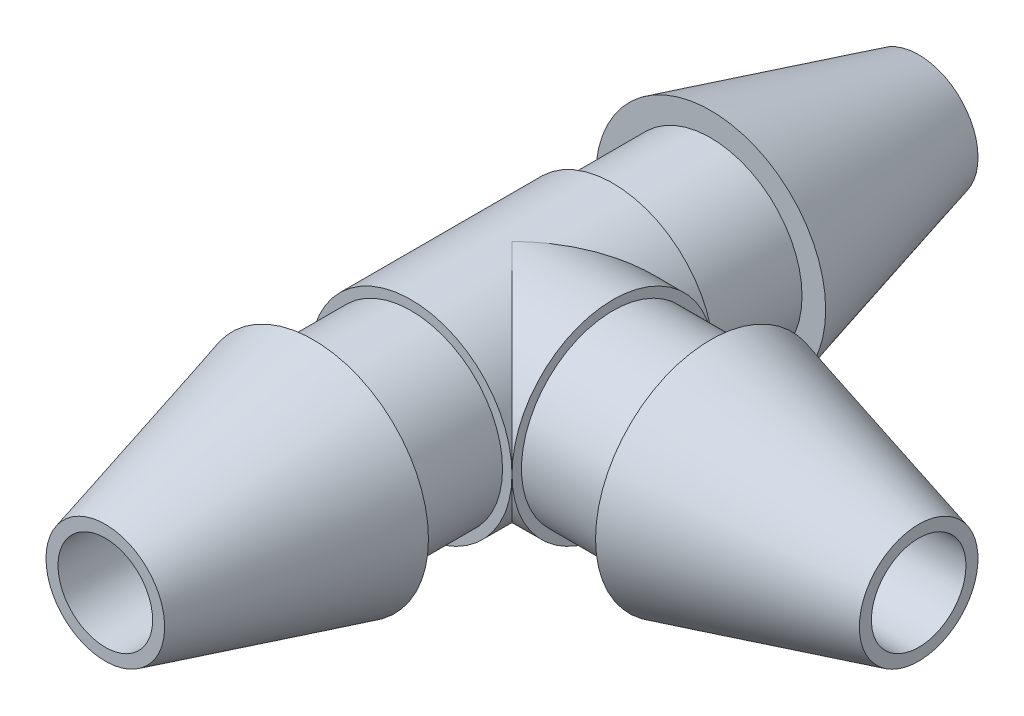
ISO-10303-21;
HEADER;
FILE_DESCRIPTION(('STEP AP214'),'2;1');
FILE_NAME('part.step','',(''),(''),'','','');
FILE_SCHEMA(('AUTOMOTIVE_DESIGN { 1 0 10303 214 1 1 1 1 }'));
ENDSEC;
DATA;
#1=APPLICATION_CONTEXT('core data for automotive mechanical design processes');
#2=APPLICATION_PROTOCOL_DEFINITION('international standard','automotive_design',2000,#1);
#3=PRODUCT_CONTEXT('',#1,'mechanical');
#4=PRODUCT('Part','Part','',(#3));
#5=PRODUCT_RELATED_PRODUCT_CATEGORY('part','',(#4));
#6=PRODUCT_DEFINITION_FORMATION('','',#4);
#7=PRODUCT_DEFINITION_CONTEXT('part definition',#1,'design');
#8=PRODUCT_DEFINITION('design','',#6,#7);
#9=PRODUCT_DEFINITION_SHAPE('','',#8);
#10=(LENGTH_UNIT() NAMED_UNIT(*) SI_UNIT(.MILLI.,.METRE.));
#11=(NAMED_UNIT(*) PLANE_ANGLE_UNIT() SI_UNIT($,.RADIAN.));
#12=(NAMED_UNIT(*) SI_UNIT($,.STERADIAN.) SOLID_ANGLE_UNIT());
#13=UNCERTAINTY_MEASURE_WITH_UNIT(LENGTH_MEASURE(1.E-05),#10,'distance_accuracy_value','');
#14=(GEOMETRIC_REPRESENTATION_CONTEXT(3) GLOBAL_UNCERTAINTY_ASSIGNED_CONTEXT((#13)) GLOBAL_UNIT_ASSIGNED_CONTEXT((#10,
#11,#12)) REPRESENTATION_CONTEXT('',''));
#15=CARTESIAN_POINT('',(0.,0.,0.));
#16=DIRECTION('',(0.,0.,1.));
#17=DIRECTION('',(1.,0.,0.));
#18=AXIS2_PLACEMENT_3D('',#15,#16,#17);
#19=CARTESIAN_POINT('',(0.,0.,-12.9));
#20=DIRECTION('',(0.,0.,1.));
#21=DIRECTION('',(1.,0.,0.));
#22=AXIS2_PLACEMENT_3D('',#19,#20,#21);
#23=CYLINDRICAL_SURFACE('',#22,1.5);
#24=CARTESIAN_POINT('',(0.,0.,12.9));
#25=DIRECTION('',(0.,0.,1.));
#26=DIRECTION('',(1.,0.,0.));
#27=AXIS2_PLACEMENT_3D('',#24,#25,#26);
#28=CIRCLE('',#27,1.5);
#29=CARTESIAN_POINT('',(1.5,0.,12.9));
#30=VERTEX_POINT('',#29);
#31=EDGE_CURVE('E174',#30,#30,#28,.T.);
#32=ORIENTED_EDGE('',*,*,#31,.T.);
#33=EDGE_LOOP('',(#32));
#34=FACE_BOUND('',#33,.T.);
#35=CARTESIAN_POINT('',(0.,0.,-12.9));
#36=DIRECTION('',(0.,0.,1.));
#37=DIRECTION('',(1.,0.,0.));
#38=AXIS2_PLACEMENT_3D('',#35,#36,#37);
#39=CIRCLE('',#38,1.5);
#40=CARTESIAN_POINT('',(1.5,0.,-12.9));
#41=VERTEX_POINT('',#40);
#42=EDGE_CURVE('E153',#41,#41,#39,.T.);
#43=ORIENTED_EDGE('',*,*,#42,.F.);
#44=EDGE_LOOP('',(#43));
#45=FACE_BOUND('',#44,.T.);
#46=CARTESIAN_POINT('',(0.,0.,0.));
#47=DIRECTION('',(-0.894427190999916,0.,0.447213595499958));
#48=DIRECTION('',(0.447213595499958,0.,0.894427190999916));
#49=AXIS2_PLACEMENT_3D('',#46,#47,#48);
#50=ELLIPSE('',#49,3.35410196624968,1.5);
#51=CARTESIAN_POINT('',(0.,1.5,0.));
#52=VERTEX_POINT('',#51);
#53=CARTESIAN_POINT('',(0.,-1.5,0.));
#54=VERTEX_POINT('',#53);
#55=EDGE_CURVE('E52',#52,#54,#50,.F.);
#56=ORIENTED_EDGE('',*,*,#55,.T.);
#57=CARTESIAN_POINT('',(0.,0.,0.));
#58=DIRECTION('',(-0.894427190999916,0.,-0.447213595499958));
#59=DIRECTION('',(0.447213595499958,0.,-0.894427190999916));
#60=AXIS2_PLACEMENT_3D('',#57,#58,#59);
#61=ELLIPSE('',#60,3.35410196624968,1.5);
#62=EDGE_CURVE('E12',#54,#52,#61,.F.);
#63=ORIENTED_EDGE('',*,*,#62,.T.);
#64=EDGE_LOOP('',(#56,#63));
#65=FACE_BOUND('',#64,.T.);
#66=ADVANCED_FACE('F39',(#34,#45,#65),#23,.F.);
#67=CARTESIAN_POINT('',(0.,0.,-6.3));
#68=DIRECTION('',(0.,0.,1.));
#69=DIRECTION('',(1.,0.,0.));
#70=AXIS2_PLACEMENT_3D('',#67,#68,#69);
#71=CYLINDRICAL_SURFACE('',#70,2.9);
#72=CARTESIAN_POINT('',(0.,0.,-6.3));
#73=DIRECTION('',(0.,0.,1.));
#74=DIRECTION('',(1.,0.,0.));
#75=AXIS2_PLACEMENT_3D('',#72,#73,#74);
#76=CIRCLE('',#75,2.9);
#77=CARTESIAN_POINT('',(2.9,0.,-6.3));
#78=VERTEX_POINT('',#77);
#79=EDGE_CURVE('E146',#78,#78,#76,.T.);
#80=ORIENTED_EDGE('',*,*,#79,.T.);
#81=EDGE_LOOP('',(#80));
#82=FACE_BOUND('',#81,.T.);
#83=CARTESIAN_POINT('',(0.,0.,-3.2));
#84=DIRECTION('',(0.,0.,1.));
#85=DIRECTION('',(1.,0.,0.));
#86=AXIS2_PLACEMENT_3D('',#83,#84,#85);
#87=CIRCLE('',#86,2.9);
#88=CARTESIAN_POINT('',(2.9,0.,-3.2));
#89=VERTEX_POINT('',#88);
#90=EDGE_CURVE('E151',#89,#89,#87,.F.);
#91=ORIENTED_EDGE('',*,*,#90,.T.);
#92=EDGE_LOOP('',(#91));
#93=FACE_BOUND('',#92,.T.);
#94=ADVANCED_FACE('F111',(#82,#93),#71,.T.);
#95=CARTESIAN_POINT('',(0.,0.,-12.9));
#96=DIRECTION('',(0.,0.,1.));
#97=DIRECTION('',(1.,0.,0.));
#98=AXIS2_PLACEMENT_3D('',#95,#96,#97);
#99=PLANE('',#98);
#100=CARTESIAN_POINT('',(0.,0.,-12.9));
#101=DIRECTION('',(0.,0.,1.));
#102=DIRECTION('',(1.,0.,0.));
#103=AXIS2_PLACEMENT_3D('',#100,#101,#102);
#104=CIRCLE('',#103,1.88153532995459);
#105=CARTESIAN_POINT('',(1.88153532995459,0.,-12.9));
#106=VERTEX_POINT('',#105);
#107=EDGE_CURVE('E148',#106,#106,#104,.F.);
#108=ORIENTED_EDGE('',*,*,#107,.T.);
#109=EDGE_LOOP('',(#108));
#110=FACE_BOUND('',#109,.T.);
#111=ORIENTED_EDGE('',*,*,#42,.T.);
#112=EDGE_LOOP('',(#111));
#113=FACE_BOUND('',#112,.T.);
#114=ADVANCED_FACE('F114',(#110,#113),#99,.F.);
#115=CARTESIAN_POINT('',(0.,0.,-6.3));
#116=DIRECTION('',(0.,0.,1.));
#117=DIRECTION('',(1.,0.,0.));
#118=AXIS2_PLACEMENT_3D('',#115,#116,#117);
#119=PLANE('',#118);
#120=ORIENTED_EDGE('',*,*,#79,.F.);
#121=EDGE_LOOP('',(#120));
#122=FACE_BOUND('',#121,.T.);
#123=CARTESIAN_POINT('',(0.,0.,-6.3));
#124=DIRECTION('',(0.,0.,1.));
#125=DIRECTION('',(1.,0.,0.));
#126=AXIS2_PLACEMENT_3D('',#123,#124,#125);
#127=CIRCLE('',#126,3.65);
#128=CARTESIAN_POINT('',(3.65,0.,-6.3));
#129=VERTEX_POINT('',#128);
#130=EDGE_CURVE('E158',#129,#129,#127,.T.);
#131=ORIENTED_EDGE('',*,*,#130,.T.);
#132=EDGE_LOOP('',(#131));
#133=FACE_BOUND('',#132,.T.);
#134=ADVANCED_FACE('F118',(#122,#133),#119,.T.);
#135=CARTESIAN_POINT('',(0.,0.,-6.29999999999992));
#136=DIRECTION('',(0.,0.,1.));
#137=DIRECTION('',(1.,0.,0.));
#138=AXIS2_PLACEMENT_3D('',#135,#136,#137);
#139=CONICAL_SURFACE('',#138,3.65,0.261799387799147);
#140=ORIENTED_EDGE('',*,*,#107,.F.);
#141=EDGE_LOOP('',(#140));
#142=FACE_BOUND('',#141,.T.);
#143=ORIENTED_EDGE('',*,*,#130,.F.);
#144=EDGE_LOOP('',(#143));
#145=FACE_BOUND('',#144,.T.);
#146=ADVANCED_FACE('F122',(#142,#145),#139,.T.);
#147=CARTESIAN_POINT('',(0.,0.,6.3));
#148=DIRECTION('',(0.,0.,-1.));
#149=DIRECTION('',(-1.,0.,0.));
#150=AXIS2_PLACEMENT_3D('',#147,#148,#149);
#151=CYLINDRICAL_SURFACE('',#150,2.9);
#152=CARTESIAN_POINT('',(0.,0.,3.2));
#153=DIRECTION('',(0.,0.,1.));
#154=DIRECTION('',(1.,0.,0.));
#155=AXIS2_PLACEMENT_3D('',#152,#153,#154);
#156=CIRCLE('',#155,2.9);
#157=CARTESIAN_POINT('',(2.9,0.,3.2));
#158=VERTEX_POINT('',#157);
#159=EDGE_CURVE('E165',#158,#158,#156,.T.);
#160=ORIENTED_EDGE('',*,*,#159,.T.);
#161=EDGE_LOOP('',(#160));
#162=FACE_BOUND('',#161,.T.);
#163=CARTESIAN_POINT('',(0.,0.,6.3));
#164=DIRECTION('',(0.,0.,1.));
#165=DIRECTION('',(1.,0.,0.));
#166=AXIS2_PLACEMENT_3D('',#163,#164,#165);
#167=CIRCLE('',#166,2.9);
#168=CARTESIAN_POINT('',(2.9,0.,6.3));
#169=VERTEX_POINT('',#168);
#170=EDGE_CURVE('E154',#169,#169,#167,.T.);
#171=ORIENTED_EDGE('',*,*,#170,.F.);
#172=EDGE_LOOP('',(#171));
#173=FACE_BOUND('',#172,.T.);
#174=ADVANCED_FACE('F125',(#162,#173),#151,.T.);
#175=CARTESIAN_POINT('',(0.,0.,3.2));
#176=DIRECTION('',(0.,0.,1.));
#177=DIRECTION('',(1.,0.,0.));
#178=AXIS2_PLACEMENT_3D('',#175,#176,#177);
#179=PLANE('',#178);
#180=CARTESIAN_POINT('',(0.,0.,3.2));
#181=DIRECTION('',(0.,0.,1.));
#182=DIRECTION('',(1.,0.,0.));
#183=AXIS2_PLACEMENT_3D('',#180,#181,#182);
#184=CIRCLE('',#183,3.2);
#185=CARTESIAN_POINT('',(3.2,0.,3.2));
#186=VERTEX_POINT('',#185);
#187=EDGE_CURVE('E170',#186,#186,#184,.T.);
#188=ORIENTED_EDGE('',*,*,#187,.T.);
#189=EDGE_LOOP('',(#188));
#190=FACE_BOUND('',#189,.T.);
#191=ORIENTED_EDGE('',*,*,#159,.F.);
#192=EDGE_LOOP('',(#191));
#193=FACE_BOUND('',#192,.T.);
#194=ADVANCED_FACE('F223',(#190,#193),#179,.T.);
#195=CARTESIAN_POINT('',(0.,0.,-3.2));
#196=DIRECTION('',(0.,0.,1.));
#197=DIRECTION('',(1.,0.,0.));
#198=AXIS2_PLACEMENT_3D('',#195,#196,#197);
#199=CYLINDRICAL_SURFACE('',#198,3.2);
#200=CARTESIAN_POINT('',(0.,0.,0.));
#201=DIRECTION('',(0.707106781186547,0.,0.707106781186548));
#202=DIRECTION('',(0.707106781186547,0.,-0.707106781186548));
#203=AXIS2_PLACEMENT_3D('',#200,#201,#202);
#204=ELLIPSE('',#203,4.5254833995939,3.2);
#205=CARTESIAN_POINT('',(3.2,0.,-3.2));
#206=VERTEX_POINT('',#205);
#207=CARTESIAN_POINT('',(0.,-3.2,0.));
#208=VERTEX_POINT('',#207);
#209=EDGE_CURVE('E65',#206,#208,#204,.F.);
#210=ORIENTED_EDGE('',*,*,#209,.T.);
#211=CARTESIAN_POINT('',(0.,0.,0.));
#212=DIRECTION('',(0.707106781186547,0.,-0.707106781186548));
#213=DIRECTION('',(0.707106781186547,0.,0.707106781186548));
#214=AXIS2_PLACEMENT_3D('',#211,#212,#213);
#215=ELLIPSE('',#214,4.5254833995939,3.2);
#216=EDGE_CURVE('E198',#208,#186,#215,.F.);
#217=ORIENTED_EDGE('',*,*,#216,.T.);
#218=ORIENTED_EDGE('',*,*,#187,.F.);
#219=CARTESIAN_POINT('',(0.,0.,0.));
#220=DIRECTION('',(0.707106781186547,0.,-0.707106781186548));
#221=DIRECTION('',(0.707106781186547,0.,0.707106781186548));
#222=AXIS2_PLACEMENT_3D('',#219,#220,#221);
#223=ELLIPSE('',#222,4.5254833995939,3.2);
#224=CARTESIAN_POINT('',(0.,3.2,0.));
#225=VERTEX_POINT('',#224);
#226=EDGE_CURVE('E189',#186,#225,#223,.F.);
#227=ORIENTED_EDGE('',*,*,#226,.T.);
#228=CARTESIAN_POINT('',(0.,0.,0.));
#229=DIRECTION('',(0.707106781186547,0.,0.707106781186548));
#230=DIRECTION('',(0.707106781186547,0.,-0.707106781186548));
#231=AXIS2_PLACEMENT_3D('',#228,#229,#230);
#232=ELLIPSE('',#231,4.5254833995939,3.2);
#233=EDGE_CURVE('E192',#225,#206,#232,.F.);
#234=ORIENTED_EDGE('',*,*,#233,.T.);
#235=CARTESIAN_POINT('',(0.,0.,-3.2));
#236=DIRECTION('',(0.,0.,1.));
#237=DIRECTION('',(1.,0.,0.));
#238=AXIS2_PLACEMENT_3D('',#235,#236,#237);
#239=CIRCLE('',#238,3.2);
#240=EDGE_CURVE('E168',#206,#206,#239,.T.);
#241=ORIENTED_EDGE('',*,*,#240,.T.);
#242=EDGE_LOOP('',(#210,#217,#218,#227,#234,#241));
#243=FACE_BOUND('',#242,.T.);
#244=ADVANCED_FACE('F202',(#243),#199,.T.);
#245=CARTESIAN_POINT('',(0.,0.,-3.2));
#246=DIRECTION('',(0.,0.,1.));
#247=DIRECTION('',(1.,0.,0.));
#248=AXIS2_PLACEMENT_3D('',#245,#246,#247);
#249=PLANE('',#248);
#250=ORIENTED_EDGE('',*,*,#90,.F.);
#251=EDGE_LOOP('',(#250));
#252=FACE_BOUND('',#251,.T.);
#253=ORIENTED_EDGE('',*,*,#240,.F.);
#254=EDGE_LOOP('',(#253));
#255=FACE_BOUND('',#254,.T.);
#256=ADVANCED_FACE('F213',(#252,#255),#249,.F.);
#257=CARTESIAN_POINT('',(0.,0.,6.3));
#258=DIRECTION('',(0.,0.,1.));
#259=DIRECTION('',(1.,0.,0.));
#260=AXIS2_PLACEMENT_3D('',#257,#258,#259);
#261=PLANE('',#260);
#262=CARTESIAN_POINT('',(0.,0.,6.3));
#263=DIRECTION('',(0.,0.,1.));
#264=DIRECTION('',(1.,0.,0.));
#265=AXIS2_PLACEMENT_3D('',#262,#263,#264);
#266=CIRCLE('',#265,3.65);
#267=CARTESIAN_POINT('',(-3.64999999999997,0.,6.3));
#268=VERTEX_POINT('',#267);
#269=EDGE_CURVE('E143',#268,#268,#266,.T.);
#270=ORIENTED_EDGE('',*,*,#269,.F.);
#271=EDGE_LOOP('',(#270));
#272=FACE_BOUND('',#271,.T.);
#273=ORIENTED_EDGE('',*,*,#170,.T.);
#274=EDGE_LOOP('',(#273));
#275=FACE_BOUND('',#274,.T.);
#276=ADVANCED_FACE('F138',(#272,#275),#261,.F.);
#277=CARTESIAN_POINT('',(0.,0.,12.9));
#278=DIRECTION('',(0.,0.,1.));
#279=DIRECTION('',(1.,0.,0.));
#280=AXIS2_PLACEMENT_3D('',#277,#278,#279);
#281=PLANE('',#280);
#282=CARTESIAN_POINT('',(0.,0.,12.9));
#283=DIRECTION('',(0.,0.,1.));
#284=DIRECTION('',(1.,0.,0.));
#285=AXIS2_PLACEMENT_3D('',#282,#283,#284);
#286=CIRCLE('',#285,1.88153532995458);
#287=CARTESIAN_POINT('',(-1.88153532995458,0.,12.9));
#288=VERTEX_POINT('',#287);
#289=EDGE_CURVE('E93',#288,#288,#286,.T.);
#290=ORIENTED_EDGE('',*,*,#289,.T.);
#291=EDGE_LOOP('',(#290));
#292=FACE_BOUND('',#291,.T.);
#293=ORIENTED_EDGE('',*,*,#31,.F.);
#294=EDGE_LOOP('',(#293));
#295=FACE_BOUND('',#294,.T.);
#296=ADVANCED_FACE('F130',(#292,#295),#281,.T.);
#297=CARTESIAN_POINT('',(0.,0.,12.9));
#298=DIRECTION('',(0.,0.,-1.));
#299=DIRECTION('',(-1.,0.,0.));
#300=AXIS2_PLACEMENT_3D('',#297,#298,#299);
#301=CONICAL_SURFACE('',#300,1.88153532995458,0.261799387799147);
#302=CARTESIAN_POINT('',(-3.64999999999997,0.,6.3));
#303=CARTESIAN_POINT('',(-3.63157849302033,0.,6.36875));
#304=CARTESIAN_POINT('',(-3.61315698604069,0.,6.4375));
#305=CARTESIAN_POINT('',(-3.57631397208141,0.,6.575));
#306=CARTESIAN_POINT('',(-3.55789246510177,0.,6.64375));
#307=CARTESIAN_POINT('',(-3.52104945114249,0.,6.78125));
#308=CARTESIAN_POINT('',(-3.50262794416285,0.,6.85));
#309=CARTESIAN_POINT('',(-3.46578493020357,0.,6.9875));
#310=CARTESIAN_POINT('',(-3.44736342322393,0.,7.05625));
#311=CARTESIAN_POINT('',(-3.41052040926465,0.,7.19375));
#312=CARTESIAN_POINT('',(-3.39209890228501,0.,7.2625));
#313=CARTESIAN_POINT('',(-3.35525588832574,0.,7.4));
#314=CARTESIAN_POINT('',(-3.3368343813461,0.,7.46875));
#315=CARTESIAN_POINT('',(-3.29999136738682,0.,7.60625));
#316=CARTESIAN_POINT('',(-3.28156986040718,0.,7.675));
#317=CARTESIAN_POINT('',(-3.2447268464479,0.,7.8125));
#318=CARTESIAN_POINT('',(-3.22630533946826,0.,7.88125));
#319=CARTESIAN_POINT('',(-3.18946232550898,0.,8.01875));
#320=CARTESIAN_POINT('',(-3.17104081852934,0.,8.0875));
#321=CARTESIAN_POINT('',(-3.13419780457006,0.,8.225));
#322=CARTESIAN_POINT('',(-3.11577629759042,0.,8.29375));
#323=CARTESIAN_POINT('',(-3.07893328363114,0.,8.43125));
#324=CARTESIAN_POINT('',(-3.0605117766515,0.,8.5));
#325=CARTESIAN_POINT('',(-3.02366876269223,0.,8.6375));
#326=CARTESIAN_POINT('',(-3.00524725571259,0.,8.70625));
#327=CARTESIAN_POINT('',(-2.96840424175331,0.,8.84375));
#328=CARTESIAN_POINT('',(-2.94998273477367,0.,8.9125));
#329=CARTESIAN_POINT('',(-2.91313972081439,0.,9.05));
#330=CARTESIAN_POINT('',(-2.89471821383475,0.,9.11875));
#331=CARTESIAN_POINT('',(-2.85787519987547,0.,9.25625));
#332=CARTESIAN_POINT('',(-2.83945369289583,0.,9.325));
#333=CARTESIAN_POINT('',(-2.80261067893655,0.,9.4625));
#334=CARTESIAN_POINT('',(-2.78418917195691,0.,9.53125));
#335=CARTESIAN_POINT('',(-2.74734615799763,0.,9.66875));
#336=CARTESIAN_POINT('',(-2.72892465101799,0.,9.7375));
#337=CARTESIAN_POINT('',(-2.69208163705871,0.,9.875));
#338=CARTESIAN_POINT('',(-2.67366013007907,0.,9.94375));
#339=CARTESIAN_POINT('',(-2.6368171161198,0.,10.08125));
#340=CARTESIAN_POINT('',(-2.61839560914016,0.,10.15));
#341=CARTESIAN_POINT('',(-2.58155259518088,0.,10.2875));
#342=CARTESIAN_POINT('',(-2.56313108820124,0.,10.35625));
#343=CARTESIAN_POINT('',(-2.52628807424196,0.,10.49375));
#344=CARTESIAN_POINT('',(-2.50786656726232,0.,10.5625));
#345=CARTESIAN_POINT('',(-2.47102355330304,0.,10.7));
#346=CARTESIAN_POINT('',(-2.4526020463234,0.,10.76875));
#347=CARTESIAN_POINT('',(-2.41575903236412,0.,10.90625));
#348=CARTESIAN_POINT('',(-2.39733752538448,0.,10.975));
#349=CARTESIAN_POINT('',(-2.3604945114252,0.,11.1125));
#350=CARTESIAN_POINT('',(-2.34207300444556,0.,11.18125));
#351=CARTESIAN_POINT('',(-2.30522999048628,0.,11.31875));
#352=CARTESIAN_POINT('',(-2.28680848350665,0.,11.3875));
#353=CARTESIAN_POINT('',(-2.24996546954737,0.,11.525));
#354=CARTESIAN_POINT('',(-2.23154396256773,0.,11.59375));
#355=CARTESIAN_POINT('',(-2.19470094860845,0.,11.73125));
#356=CARTESIAN_POINT('',(-2.17627944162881,0.,11.8));
#357=CARTESIAN_POINT('',(-2.13943642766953,0.,11.9375));
#358=CARTESIAN_POINT('',(-2.12101492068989,0.,12.00625));
#359=CARTESIAN_POINT('',(-2.08417190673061,0.,12.14375));
#360=CARTESIAN_POINT('',(-2.06575039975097,0.,12.2125));
#361=CARTESIAN_POINT('',(-2.02890738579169,0.,12.35));
#362=CARTESIAN_POINT('',(-2.01048587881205,0.,12.41875));
#363=CARTESIAN_POINT('',(-1.97364286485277,0.,12.55625));
#364=CARTESIAN_POINT('',(-1.95522135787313,0.,12.625));
#365=CARTESIAN_POINT('',(-1.91837834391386,0.,12.7625));
#366=CARTESIAN_POINT('',(-1.89995683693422,0.,12.83125));
#367=CARTESIAN_POINT('',(-1.88153532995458,0.,12.9));
#368=B_SPLINE_CURVE_WITH_KNOTS('',3,(#302,#303,#304,#305,#306,#307,#308,#309,#310,#311,#312,
#313,#314,#315,#316,#317,#318,#319,#320,#321,#322,#323,#324,#325,#326,#327,#328,#329,#330,#331,
#332,#333,#334,#335,#336,#337,#338,#339,#340,#341,#342,#343,#344,#345,#346,#347,#348,#349,#350,
#351,#352,#353,#354,#355,#356,#357,#358,#359,#360,#361,#362,#363,#364,#365,#366,#367),
.UNSPECIFIED.,.F.,.F.,(4,2,2,2,2,2,2,2,2,2,2,2,2,2,2,2,2,2,2,2,2,2,2,2,2,2,2,2,2,2,2,2,4),(0.,
0.213525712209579,0.427051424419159,0.640577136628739,0.854102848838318,1.0676285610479,
1.28115427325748,1.49467998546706,1.70820569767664,1.92173140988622,2.13525712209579,
2.34878283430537,2.56230854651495,2.77583425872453,2.98935997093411,3.20288568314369,
3.41641139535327,3.62993710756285,3.84346281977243,4.05698853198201,4.27051424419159,
4.48403995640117,4.69756566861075,4.91109138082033,5.12461709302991,5.33814280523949,
5.55166851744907,5.76519422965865,5.97871994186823,6.19224565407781,6.40577136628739,
6.61929707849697,6.83282279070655),.UNSPECIFIED.);
#369=EDGE_CURVE('BSEAM127',#268,#288,#368,.T.);
#370=ORIENTED_EDGE('',*,*,#269,.T.);
#371=ORIENTED_EDGE('',*,*,#289,.F.);
#372=ORIENTED_EDGE('',*,*,#369,.T.);
#373=ORIENTED_EDGE('',*,*,#369,.F.);
#374=EDGE_LOOP('',(#370,#372,#371,#373));
#375=FACE_BOUND('',#374,.T.);
#376=ADVANCED_FACE('F127',(#375),#301,.T.);
#377=CARTESIAN_POINT('',(-500000.,0.,0.));
#378=DIRECTION('',(1.,0.,0.));
#379=DIRECTION('',(0.,0.,-1.));
#380=AXIS2_PLACEMENT_3D('',#377,#378,#379);
#381=CYLINDRICAL_SURFACE('',#380,2.9);
#382=CARTESIAN_POINT('',(3.19999999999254,0.,0.));
#383=DIRECTION('',(1.,0.,0.));
#384=DIRECTION('',(0.,0.,-1.));
#385=AXIS2_PLACEMENT_3D('',#382,#383,#384);
#386=CIRCLE('',#385,2.9);
#387=CARTESIAN_POINT('',(3.19999999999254,0.,-2.9));
#388=VERTEX_POINT('',#387);
#389=EDGE_CURVE('E186',#388,#388,#386,.F.);
#390=ORIENTED_EDGE('',*,*,#389,.F.);
#391=EDGE_LOOP('',(#390));
#392=FACE_BOUND('',#391,.T.);
#393=CARTESIAN_POINT('',(6.3,0.,0.));
#394=DIRECTION('',(1.,0.,0.));
#395=DIRECTION('',(0.,0.,-1.));
#396=AXIS2_PLACEMENT_3D('',#393,#394,#395);
#397=CIRCLE('',#396,2.9);
#398=CARTESIAN_POINT('',(6.3,0.,-2.9));
#399=VERTEX_POINT('',#398);
#400=EDGE_CURVE('E177',#399,#399,#397,.T.);
#401=ORIENTED_EDGE('',*,*,#400,.F.);
#402=EDGE_LOOP('',(#401));
#403=FACE_BOUND('',#402,.T.);
#404=ADVANCED_FACE('F129',(#392,#403),#381,.T.);
#405=CARTESIAN_POINT('',(12.9,0.,0.));
#406=DIRECTION('',(1.,0.,0.));
#407=DIRECTION('',(0.,0.,-1.));
#408=AXIS2_PLACEMENT_3D('',#405,#406,#407);
#409=PLANE('',#408);
#410=CARTESIAN_POINT('',(12.9,0.,0.));
#411=DIRECTION('',(1.,0.,0.));
#412=DIRECTION('',(0.,0.,-1.));
#413=AXIS2_PLACEMENT_3D('',#410,#411,#412);
#414=CIRCLE('',#413,1.8815353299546);
#415=CARTESIAN_POINT('',(12.9,0.,1.8815353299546));
#416=VERTEX_POINT('',#415);
#417=EDGE_CURVE('E90',#416,#416,#414,.T.);
#418=ORIENTED_EDGE('',*,*,#417,.T.);
#419=EDGE_LOOP('',(#418));
#420=FACE_BOUND('',#419,.T.);
#421=CARTESIAN_POINT('',(12.9,0.,0.));
#422=DIRECTION('',(1.,0.,0.));
#423=DIRECTION('',(0.,0.,-1.));
#424=AXIS2_PLACEMENT_3D('',#421,#422,#423);
#425=CIRCLE('',#424,1.5);
#426=CARTESIAN_POINT('',(12.9,0.,-1.5));
#427=VERTEX_POINT('',#426);
#428=EDGE_CURVE('E183',#427,#427,#425,.T.);
#429=ORIENTED_EDGE('',*,*,#428,.F.);
#430=EDGE_LOOP('',(#429));
#431=FACE_BOUND('',#430,.T.);
#432=ADVANCED_FACE('F136',(#420,#431),#409,.T.);
#433=CARTESIAN_POINT('',(6.3,0.,0.));
#434=DIRECTION('',(1.,0.,0.));
#435=DIRECTION('',(0.,0.,-1.));
#436=AXIS2_PLACEMENT_3D('',#433,#434,#435);
#437=PLANE('',#436);
#438=ORIENTED_EDGE('',*,*,#400,.T.);
#439=EDGE_LOOP('',(#438));
#440=FACE_BOUND('',#439,.T.);
#441=CARTESIAN_POINT('',(6.3,0.,0.));
#442=DIRECTION('',(1.,0.,0.));
#443=DIRECTION('',(0.,0.,-1.));
#444=AXIS2_PLACEMENT_3D('',#441,#442,#443);
#445=CIRCLE('',#444,3.65);
#446=CARTESIAN_POINT('',(6.3,0.,3.64999999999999));
#447=VERTEX_POINT('',#446);
#448=EDGE_CURVE('E180',#447,#447,#445,.T.);
#449=ORIENTED_EDGE('',*,*,#448,.F.);
#450=EDGE_LOOP('',(#449));
#451=FACE_BOUND('',#450,.T.);
#452=ADVANCED_FACE('F304',(#440,#451),#437,.F.);
#453=CARTESIAN_POINT('',(-500000.,0.,0.));
#454=DIRECTION('',(1.,0.,0.));
#455=DIRECTION('',(0.,0.,-1.));
#456=AXIS2_PLACEMENT_3D('',#453,#454,#455);
#457=CYLINDRICAL_SURFACE('',#456,1.5);
#458=ORIENTED_EDGE('',*,*,#428,.T.);
#459=EDGE_LOOP('',(#458));
#460=FACE_BOUND('',#459,.T.);
#461=CARTESIAN_POINT('',(0.,0.,0.));
#462=DIRECTION('',(-0.447213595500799,0.,0.894427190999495));
#463=DIRECTION('',(0.894427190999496,0.,0.447213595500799));
#464=AXIS2_PLACEMENT_3D('',#461,#462,#463);
#465=ELLIPSE('',#464,3.35410196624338,1.5);
#466=EDGE_CURVE('E88',#54,#52,#465,.T.);
#467=ORIENTED_EDGE('',*,*,#466,.T.);
#468=CARTESIAN_POINT('',(0.,0.,0.));
#469=DIRECTION('',(-0.447213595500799,0.,-0.894427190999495));
#470=DIRECTION('',(0.894427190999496,0.,-0.447213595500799));
#471=AXIS2_PLACEMENT_3D('',#468,#469,#470);
#472=ELLIPSE('',#471,3.35410196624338,1.5);
#473=EDGE_CURVE('E82',#52,#54,#472,.T.);
#474=ORIENTED_EDGE('',*,*,#473,.T.);
#475=EDGE_LOOP('',(#467,#474));
#476=FACE_BOUND('',#475,.T.);
#477=ADVANCED_FACE('F87',(#460,#476),#457,.F.);
#478=CARTESIAN_POINT('',(12.9,0.,0.));
#479=DIRECTION('',(-1.,0.,0.));
#480=DIRECTION('',(0.,0.,1.));
#481=AXIS2_PLACEMENT_3D('',#478,#479,#480);
#482=CONICAL_SURFACE('',#481,1.8815353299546,0.261799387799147);
#483=CARTESIAN_POINT('',(6.3,0.,3.64999999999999));
#484=CARTESIAN_POINT('',(6.36875,0.,3.63157849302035));
#485=CARTESIAN_POINT('',(6.4375,0.,3.61315698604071));
#486=CARTESIAN_POINT('',(6.575,0.,3.57631397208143));
#487=CARTESIAN_POINT('',(6.64375,0.,3.55789246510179));
#488=CARTESIAN_POINT('',(6.78125,0.,3.52104945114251));
#489=CARTESIAN_POINT('',(6.85,0.,3.50262794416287));
#490=CARTESIAN_POINT('',(6.9875,0.,3.46578493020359));
#491=CARTESIAN_POINT('',(7.05625,0.,3.44736342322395));
#492=CARTESIAN_POINT('',(7.19375,0.,3.41052040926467));
#493=CARTESIAN_POINT('',(7.2625,0.,3.39209890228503));
#494=CARTESIAN_POINT('',(7.4,0.,3.35525588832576));
#495=CARTESIAN_POINT('',(7.46875,0.,3.33683438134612));
#496=CARTESIAN_POINT('',(7.60625,0.,3.29999136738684));
#497=CARTESIAN_POINT('',(7.675,0.,3.2815698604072));
#498=CARTESIAN_POINT('',(7.8125,0.,3.24472684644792));
#499=CARTESIAN_POINT('',(7.88125,0.,3.22630533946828));
#500=CARTESIAN_POINT('',(8.01875,0.,3.189462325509));
#501=CARTESIAN_POINT('',(8.0875,0.,3.17104081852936));
#502=CARTESIAN_POINT('',(8.225,0.,3.13419780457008));
#503=CARTESIAN_POINT('',(8.29375,0.,3.11577629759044));
#504=CARTESIAN_POINT('',(8.43125,0.,3.07893328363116));
#505=CARTESIAN_POINT('',(8.5,0.,3.06051177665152));
#506=CARTESIAN_POINT('',(8.6375,0.,3.02366876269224));
#507=CARTESIAN_POINT('',(8.70625,0.,3.00524725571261));
#508=CARTESIAN_POINT('',(8.84375,0.,2.96840424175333));
#509=CARTESIAN_POINT('',(8.9125,0.,2.94998273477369));
#510=CARTESIAN_POINT('',(9.05,0.,2.91313972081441));
#511=CARTESIAN_POINT('',(9.11875,0.,2.89471821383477));
#512=CARTESIAN_POINT('',(9.25625,0.,2.85787519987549));
#513=CARTESIAN_POINT('',(9.325,0.,2.83945369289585));
#514=CARTESIAN_POINT('',(9.4625,0.,2.80261067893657));
#515=CARTESIAN_POINT('',(9.53125,0.,2.78418917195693));
#516=CARTESIAN_POINT('',(9.66875,0.,2.74734615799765));
#517=CARTESIAN_POINT('',(9.7375,0.,2.72892465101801));
#518=CARTESIAN_POINT('',(9.875,0.,2.69208163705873));
#519=CARTESIAN_POINT('',(9.94375,0.,2.67366013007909));
#520=CARTESIAN_POINT('',(10.08125,0.,2.63681711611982));
#521=CARTESIAN_POINT('',(10.15,0.,2.61839560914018));
#522=CARTESIAN_POINT('',(10.2875,0.,2.5815525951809));
#523=CARTESIAN_POINT('',(10.35625,0.,2.56313108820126));
#524=CARTESIAN_POINT('',(10.49375,0.,2.52628807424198));
#525=CARTESIAN_POINT('',(10.5625,0.,2.50786656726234));
#526=CARTESIAN_POINT('',(10.7,0.,2.47102355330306));
#527=CARTESIAN_POINT('',(10.76875,0.,2.45260204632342));
#528=CARTESIAN_POINT('',(10.90625,0.,2.41575903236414));
#529=CARTESIAN_POINT('',(10.975,0.,2.3973375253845));
#530=CARTESIAN_POINT('',(11.1125,0.,2.36049451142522));
#531=CARTESIAN_POINT('',(11.18125,0.,2.34207300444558));
#532=CARTESIAN_POINT('',(11.31875,0.,2.30522999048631));
#533=CARTESIAN_POINT('',(11.3875,0.,2.28680848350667));
#534=CARTESIAN_POINT('',(11.525,0.,2.24996546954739));
#535=CARTESIAN_POINT('',(11.59375,0.,2.23154396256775));
#536=CARTESIAN_POINT('',(11.73125,0.,2.19470094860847));
#537=CARTESIAN_POINT('',(11.8,0.,2.17627944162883));
#538=CARTESIAN_POINT('',(11.9375,0.,2.13943642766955));
#539=CARTESIAN_POINT('',(12.00625,0.,2.12101492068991));
#540=CARTESIAN_POINT('',(12.14375,0.,2.08417190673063));
#541=CARTESIAN_POINT('',(12.2125,0.,2.06575039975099));
#542=CARTESIAN_POINT('',(12.35,0.,2.02890738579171));
#543=CARTESIAN_POINT('',(12.41875,0.,2.01048587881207));
#544=CARTESIAN_POINT('',(12.55625,0.,1.97364286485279));
#545=CARTESIAN_POINT('',(12.625,0.,1.95522135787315));
#546=CARTESIAN_POINT('',(12.7625,0.,1.91837834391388));
#547=CARTESIAN_POINT('',(12.83125,0.,1.89995683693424));
#548=CARTESIAN_POINT('',(12.9,0.,1.8815353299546));
#549=B_SPLINE_CURVE_WITH_KNOTS('',3,(#483,#484,#485,#486,#487,#488,#489,#490,#491,#492,#493,
#494,#495,#496,#497,#498,#499,#500,#501,#502,#503,#504,#505,#506,#507,#508,#509,#510,#511,#512,
#513,#514,#515,#516,#517,#518,#519,#520,#521,#522,#523,#524,#525,#526,#527,#528,#529,#530,#531,
#532,#533,#534,#535,#536,#537,#538,#539,#540,#541,#542,#543,#544,#545,#546,#547,#548),
.UNSPECIFIED.,.F.,.F.,(4,2,2,2,2,2,2,2,2,2,2,2,2,2,2,2,2,2,2,2,2,2,2,2,2,2,2,2,2,2,2,2,4),(0.,
0.213525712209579,0.427051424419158,0.640577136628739,0.854102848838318,1.0676285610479,
1.28115427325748,1.49467998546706,1.70820569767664,1.92173140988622,2.13525712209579,
2.34878283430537,2.56230854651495,2.77583425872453,2.98935997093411,3.20288568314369,
3.41641139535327,3.62993710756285,3.84346281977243,4.05698853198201,4.27051424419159,
4.48403995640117,4.69756566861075,4.91109138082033,5.12461709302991,5.33814280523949,
5.55166851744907,5.76519422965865,5.97871994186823,6.19224565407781,6.40577136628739,
6.61929707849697,6.83282279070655),.UNSPECIFIED.);
#550=EDGE_CURVE('BSEAM102',#447,#416,#549,.T.);
#551=ORIENTED_EDGE('',*,*,#448,.T.);
#552=ORIENTED_EDGE('',*,*,#417,.F.);
#553=ORIENTED_EDGE('',*,*,#550,.T.);
#554=ORIENTED_EDGE('',*,*,#550,.F.);
#555=EDGE_LOOP('',(#551,#553,#552,#554));
#556=FACE_BOUND('',#555,.T.);
#557=ADVANCED_FACE('F102',(#556),#482,.T.);
#558=CARTESIAN_POINT('',(3.2,0.,0.));
#559=DIRECTION('',(1.,0.,0.));
#560=DIRECTION('',(0.,0.,-1.));
#561=AXIS2_PLACEMENT_3D('',#558,#559,#560);
#562=PLANE('',#561);
#563=ORIENTED_EDGE('',*,*,#389,.T.);
#564=EDGE_LOOP('',(#563));
#565=FACE_BOUND('',#564,.T.);
#566=CARTESIAN_POINT('',(3.2,0.,0.));
#567=DIRECTION('',(1.,0.,0.));
#568=DIRECTION('',(0.,0.,-1.));
#569=AXIS2_PLACEMENT_3D('',#566,#567,#568);
#570=CIRCLE('',#569,3.2);
#571=EDGE_CURVE('E190',#206,#186,#570,.T.);
#572=ORIENTED_EDGE('',*,*,#571,.T.);
#573=CARTESIAN_POINT('',(3.2,0.,0.));
#574=DIRECTION('',(1.,0.,0.));
#575=DIRECTION('',(0.,0.,-1.));
#576=AXIS2_PLACEMENT_3D('',#573,#574,#575);
#577=CIRCLE('',#576,3.2);
#578=EDGE_CURVE('E195',#186,#206,#577,.T.);
#579=ORIENTED_EDGE('',*,*,#578,.T.);
#580=EDGE_LOOP('',(#572,#579));
#581=FACE_BOUND('',#580,.T.);
#582=ADVANCED_FACE('F205',(#565,#581),#562,.T.);
#583=CARTESIAN_POINT('',(-3.651,0.,0.));
#584=DIRECTION('',(1.,0.,0.));
#585=DIRECTION('',(0.,0.,-1.));
#586=AXIS2_PLACEMENT_3D('',#583,#584,#585);
#587=CYLINDRICAL_SURFACE('',#586,3.2);
#588=ORIENTED_EDGE('',*,*,#233,.F.);
#589=ORIENTED_EDGE('',*,*,#226,.F.);
#590=ORIENTED_EDGE('',*,*,#571,.F.);
#591=EDGE_LOOP('',(#588,#589,#590));
#592=FACE_BOUND('',#591,.T.);
#593=ADVANCED_FACE('F210',(#592),#587,.T.);
#594=CARTESIAN_POINT('',(-3.651,0.,0.));
#595=DIRECTION('',(1.,0.,0.));
#596=DIRECTION('',(0.,0.,-1.));
#597=AXIS2_PLACEMENT_3D('',#594,#595,#596);
#598=CYLINDRICAL_SURFACE('',#597,3.2);
#599=ORIENTED_EDGE('',*,*,#209,.F.);
#600=ORIENTED_EDGE('',*,*,#578,.F.);
#601=ORIENTED_EDGE('',*,*,#216,.F.);
#602=EDGE_LOOP('',(#599,#600,#601));
#603=FACE_BOUND('',#602,.T.);
#604=ADVANCED_FACE('F101',(#603),#598,.T.);
#605=CARTESIAN_POINT('',(0.,-1.5,0.));
#606=CARTESIAN_POINT('',(0.,-1.5,0.));
#607=CARTESIAN_POINT('',(0.,-1.5,0.));
#608=CARTESIAN_POINT('',(0.130694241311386,-1.49997370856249,-0.0653471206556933));
#609=CARTESIAN_POINT('',(0.0980406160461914,-1.50019157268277,-0.0980406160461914));
#610=CARTESIAN_POINT('',(0.0653471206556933,-1.49997370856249,-0.130694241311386));
#611=CARTESIAN_POINT('',(0.261421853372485,-1.49572763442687,-0.130710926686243));
#612=CARTESIAN_POINT('',(0.196350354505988,-1.49145348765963,-0.196350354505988));
#613=CARTESIAN_POINT('',(0.130710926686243,-1.49572763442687,-0.261421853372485));
#614=CARTESIAN_POINT('',(0.520628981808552,-1.47867971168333,-0.260314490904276));
#615=CARTESIAN_POINT('',(0.389061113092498,-1.45737490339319,-0.389061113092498));
#616=CARTESIAN_POINT('',(0.260314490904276,-1.47867971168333,-0.520628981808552));
#617=CARTESIAN_POINT('',(0.64911816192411,-1.46595089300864,-0.324559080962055));
#618=CARTESIAN_POINT('',(0.484018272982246,-1.43198520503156,-0.484018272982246));
#619=CARTESIAN_POINT('',(0.324559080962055,-1.46595089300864,-0.64911816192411));
#620=CARTESIAN_POINT('',(0.901660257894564,-1.43211276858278,-0.450830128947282));
#621=CARTESIAN_POINT('',(0.666698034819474,-1.36555915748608,-0.666698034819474));
#622=CARTESIAN_POINT('',(0.450830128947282,-1.43211276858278,-0.901660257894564));
#623=CARTESIAN_POINT('',(1.02575143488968,-1.41114760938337,-0.512875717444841));
#624=CARTESIAN_POINT('',(0.754969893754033,-1.32442582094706,-0.754969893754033));
#625=CARTESIAN_POINT('',(0.512875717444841,-1.41114760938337,-1.02575143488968));
#626=CARTESIAN_POINT('',(1.26733640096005,-1.36111493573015,-0.633668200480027));
#627=CARTESIAN_POINT('',(0.921061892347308,-1.2286279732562,-0.921061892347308));
#628=CARTESIAN_POINT('',(0.633668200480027,-1.36111493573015,-1.26733640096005));
#629=CARTESIAN_POINT('',(1.38491740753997,-1.33225974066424,-0.692458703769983));
#630=CARTESIAN_POINT('',(0.999413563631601,-1.17381845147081,-0.999413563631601));
#631=CARTESIAN_POINT('',(0.692458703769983,-1.33225974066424,-1.38491740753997));
#632=CARTESIAN_POINT('',(1.61141950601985,-1.26687391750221,-0.805709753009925));
#633=CARTESIAN_POINT('',(1.14267155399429,-1.05375106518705,-1.14267155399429));
#634=CARTESIAN_POINT('',(0.805709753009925,-1.26687391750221,-1.61141950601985));
#635=CARTESIAN_POINT('',(1.72049711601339,-1.23061683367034,-0.860248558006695));
#636=CARTESIAN_POINT('',(1.20807823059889,-0.988305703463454,-1.20807823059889));
#637=CARTESIAN_POINT('',(0.860248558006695,-1.23061683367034,-1.72049711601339));
#638=CARTESIAN_POINT('',(1.92805222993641,-1.15098522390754,-0.964026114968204));
#639=CARTESIAN_POINT('',(1.32292434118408,-0.851319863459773,-1.32292434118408));
#640=CARTESIAN_POINT('',(0.964026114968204,-1.15098522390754,-1.92805222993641));
#641=CARTESIAN_POINT('',(2.02677501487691,-1.10793345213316,-1.01338750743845));
#642=CARTESIAN_POINT('',(1.37281467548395,-0.779561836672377,-1.37281467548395));
#643=CARTESIAN_POINT('',(1.01338750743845,-1.10793345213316,-2.02677501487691));
#644=CARTESIAN_POINT('',(2.21183784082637,-1.01540083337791,-1.10591892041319));
#645=CARTESIAN_POINT('',(1.45501803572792,-0.635692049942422,-1.45501803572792));
#646=CARTESIAN_POINT('',(1.10591892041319,-1.01540083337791,-2.21183784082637));
#647=CARTESIAN_POINT('',(2.29852623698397,-0.96627201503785,-1.14926311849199));
#648=CARTESIAN_POINT('',(1.48771309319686,-0.563355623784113,-1.48771309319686));
#649=CARTESIAN_POINT('',(1.14926311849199,-0.96627201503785,-2.29852623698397));
#650=CARTESIAN_POINT('',(2.45792901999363,-0.862400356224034,-1.22896450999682));
#651=CARTESIAN_POINT('',(1.53552100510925,-0.425305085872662,-1.53552100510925));
#652=CARTESIAN_POINT('',(1.22896450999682,-0.862400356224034,-2.45792901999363));
#653=CARTESIAN_POINT('',(2.53109637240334,-0.808009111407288,-1.26554818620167));
#654=CARTESIAN_POINT('',(1.55093268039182,-0.359391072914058,-1.55093268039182));
#655=CARTESIAN_POINT('',(1.26554818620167,-0.808009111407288,-2.53109637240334));
#656=CARTESIAN_POINT('',(2.66209794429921,-0.69455281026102,-1.3310489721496));
#657=CARTESIAN_POINT('',(1.56664155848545,-0.241488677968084,-1.56664155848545));
#658=CARTESIAN_POINT('',(1.3310489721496,-0.69455281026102,-2.66209794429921));
#659=CARTESIAN_POINT('',(2.72046662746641,-0.635800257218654,-1.36023331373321));
#660=CARTESIAN_POINT('',(1.56715281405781,-0.189356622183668,-1.56715281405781));
#661=CARTESIAN_POINT('',(1.36023331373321,-0.635800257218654,-2.72046662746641));
#662=CARTESIAN_POINT('',(2.82079579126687,-0.51468228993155,-1.41039789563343));
#663=CARTESIAN_POINT('',(1.55859035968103,-0.104507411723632,-1.55859035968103));
#664=CARTESIAN_POINT('',(1.41039789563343,-0.51468228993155,-2.82079579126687));
#665=CARTESIAN_POINT('',(2.86331182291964,-0.452550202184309,-1.43165591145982));
#666=CARTESIAN_POINT('',(1.54965971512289,-0.0717162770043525,-1.54965971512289));
#667=CARTESIAN_POINT('',(1.43165591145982,-0.452550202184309,-2.86331182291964));
#668=CARTESIAN_POINT('',(2.93120825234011,-0.325838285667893,-1.46560412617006));
#669=CARTESIAN_POINT('',(1.53014285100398,-0.0260070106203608,-1.53014285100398));
#670=CARTESIAN_POINT('',(1.46560412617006,-0.325838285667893,-2.93120825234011));
#671=CARTESIAN_POINT('',(2.95706484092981,-0.261387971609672,-1.4785324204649));
#672=CARTESIAN_POINT('',(1.51964788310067,-0.013067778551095,-1.51964788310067));
#673=CARTESIAN_POINT('',(1.4785324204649,-0.261387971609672,-2.95706484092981));
#674=CARTESIAN_POINT('',(2.99132098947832,-0.131266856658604,-1.49566049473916));
#675=CARTESIAN_POINT('',(1.50455269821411,-8.65760121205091E-05,-1.50455269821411));
#676=CARTESIAN_POINT('',(1.49566049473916,-0.131266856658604,-2.99132098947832));
#677=CARTESIAN_POINT('',(3.,-0.0656334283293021,-1.5));
#678=CARTESIAN_POINT('',(1.5,-4.34143246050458E-05,-1.5));
#679=CARTESIAN_POINT('',(1.5,-0.0656334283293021,-3.));
#680=CARTESIAN_POINT('',(3.,0.0656334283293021,-1.5));
#681=CARTESIAN_POINT('',(1.5,4.34143246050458E-05,-1.5));
#682=CARTESIAN_POINT('',(1.5,0.0656334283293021,-3.));
#683=CARTESIAN_POINT('',(2.99132098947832,0.131266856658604,-1.49566049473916));
#684=CARTESIAN_POINT('',(1.50455269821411,8.65760121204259E-05,-1.50455269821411));
#685=CARTESIAN_POINT('',(1.49566049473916,0.131266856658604,-2.99132098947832));
#686=CARTESIAN_POINT('',(2.95706484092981,0.261387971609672,-1.4785324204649));
#687=CARTESIAN_POINT('',(1.51964788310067,0.0130677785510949,-1.51964788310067));
#688=CARTESIAN_POINT('',(1.4785324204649,0.261387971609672,-2.95706484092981));
#689=CARTESIAN_POINT('',(2.93120825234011,0.325838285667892,-1.46560412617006));
#690=CARTESIAN_POINT('',(1.53014285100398,0.0260070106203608,-1.53014285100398));
#691=CARTESIAN_POINT('',(1.46560412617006,0.325838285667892,-2.93120825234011));
#692=CARTESIAN_POINT('',(2.86331182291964,0.452550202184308,-1.43165591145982));
#693=CARTESIAN_POINT('',(1.54965971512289,0.0717162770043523,-1.54965971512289));
#694=CARTESIAN_POINT('',(1.43165591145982,0.452550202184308,-2.86331182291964));
#695=CARTESIAN_POINT('',(2.82079579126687,0.514682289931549,-1.41039789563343));
#696=CARTESIAN_POINT('',(1.55859035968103,0.104507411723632,-1.55859035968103));
#697=CARTESIAN_POINT('',(1.41039789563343,0.514682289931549,-2.82079579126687));
#698=CARTESIAN_POINT('',(2.72046662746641,0.635800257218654,-1.36023331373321));
#699=CARTESIAN_POINT('',(1.56715281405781,0.189356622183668,-1.56715281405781));
#700=CARTESIAN_POINT('',(1.36023331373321,0.635800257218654,-2.72046662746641));
#701=CARTESIAN_POINT('',(2.66209794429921,0.694552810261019,-1.3310489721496));
#702=CARTESIAN_POINT('',(1.56664155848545,0.241488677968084,-1.56664155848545));
#703=CARTESIAN_POINT('',(1.3310489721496,0.694552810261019,-2.66209794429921));
#704=CARTESIAN_POINT('',(2.53109637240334,0.808009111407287,-1.26554818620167));
#705=CARTESIAN_POINT('',(1.55093268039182,0.359391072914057,-1.55093268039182));
#706=CARTESIAN_POINT('',(1.26554818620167,0.808009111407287,-2.53109637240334));
#707=CARTESIAN_POINT('',(2.45792901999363,0.862400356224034,-1.22896450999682));
#708=CARTESIAN_POINT('',(1.53552100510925,0.425305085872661,-1.53552100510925));
#709=CARTESIAN_POINT('',(1.22896450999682,0.862400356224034,-2.45792901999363));
#710=CARTESIAN_POINT('',(2.29852623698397,0.96627201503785,-1.14926311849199));
#711=CARTESIAN_POINT('',(1.48771309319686,0.563355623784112,-1.48771309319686));
#712=CARTESIAN_POINT('',(1.14926311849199,0.96627201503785,-2.29852623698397));
#713=CARTESIAN_POINT('',(2.21183784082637,1.01540083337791,-1.10591892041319));
#714=CARTESIAN_POINT('',(1.45501803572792,0.635692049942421,-1.45501803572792));
#715=CARTESIAN_POINT('',(1.10591892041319,1.01540083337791,-2.21183784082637));
#716=CARTESIAN_POINT('',(2.02677501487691,1.10793345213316,-1.01338750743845));
#717=CARTESIAN_POINT('',(1.37281467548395,0.779561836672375,-1.37281467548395));
#718=CARTESIAN_POINT('',(1.01338750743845,1.10793345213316,-2.02677501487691));
#719=CARTESIAN_POINT('',(1.92805222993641,1.15098522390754,-0.964026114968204));
#720=CARTESIAN_POINT('',(1.32292434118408,0.851319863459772,-1.32292434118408));
#721=CARTESIAN_POINT('',(0.964026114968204,1.15098522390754,-1.92805222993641));
#722=CARTESIAN_POINT('',(1.72049711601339,1.23061683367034,-0.860248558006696));
#723=CARTESIAN_POINT('',(1.20807823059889,0.988305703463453,-1.20807823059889));
#724=CARTESIAN_POINT('',(0.860248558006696,1.23061683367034,-1.72049711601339));
#725=CARTESIAN_POINT('',(1.61141950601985,1.26687391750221,-0.805709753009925));
#726=CARTESIAN_POINT('',(1.14267155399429,1.05375106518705,-1.14267155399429));
#727=CARTESIAN_POINT('',(0.805709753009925,1.26687391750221,-1.61141950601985));
#728=CARTESIAN_POINT('',(1.38491740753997,1.33225974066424,-0.692458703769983));
#729=CARTESIAN_POINT('',(0.999413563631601,1.17381845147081,-0.999413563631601));
#730=CARTESIAN_POINT('',(0.692458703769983,1.33225974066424,-1.38491740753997));
#731=CARTESIAN_POINT('',(1.26733640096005,1.36111493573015,-0.633668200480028));
#732=CARTESIAN_POINT('',(0.921061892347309,1.2286279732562,-0.921061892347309));
#733=CARTESIAN_POINT('',(0.633668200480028,1.36111493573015,-1.26733640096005));
#734=CARTESIAN_POINT('',(1.02575143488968,1.41114760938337,-0.512875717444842));
#735=CARTESIAN_POINT('',(0.754969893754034,1.32442582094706,-0.754969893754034));
#736=CARTESIAN_POINT('',(0.512875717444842,1.41114760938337,-1.02575143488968));
#737=CARTESIAN_POINT('',(0.901660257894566,1.43211276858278,-0.450830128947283));
#738=CARTESIAN_POINT('',(0.666698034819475,1.36555915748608,-0.666698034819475));
#739=CARTESIAN_POINT('',(0.450830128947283,1.43211276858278,-0.901660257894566));
#740=CARTESIAN_POINT('',(0.649118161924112,1.46595089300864,-0.324559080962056));
#741=CARTESIAN_POINT('',(0.484018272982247,1.43198520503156,-0.484018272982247));
#742=CARTESIAN_POINT('',(0.324559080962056,1.46595089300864,-0.649118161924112));
#743=CARTESIAN_POINT('',(0.520628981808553,1.47867971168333,-0.260314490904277));
#744=CARTESIAN_POINT('',(0.389061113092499,1.45737490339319,-0.389061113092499));
#745=CARTESIAN_POINT('',(0.260314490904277,1.47867971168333,-0.520628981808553));
#746=CARTESIAN_POINT('',(0.261421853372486,1.49572763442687,-0.130710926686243));
#747=CARTESIAN_POINT('',(0.196350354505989,1.49145348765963,-0.196350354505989));
#748=CARTESIAN_POINT('',(0.130710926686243,1.49572763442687,-0.261421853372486));
#749=CARTESIAN_POINT('',(0.130694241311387,1.49997370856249,-0.0653471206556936));
#750=CARTESIAN_POINT('',(0.098040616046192,1.50019157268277,-0.098040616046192));
#751=CARTESIAN_POINT('',(0.0653471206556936,1.49997370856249,-0.130694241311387));
#752=CARTESIAN_POINT('',(0.,1.5,0.));
#753=CARTESIAN_POINT('',(0.,1.5,0.));
#754=CARTESIAN_POINT('',(0.,1.5,0.));
#755=(BOUNDED_SURFACE() B_SPLINE_SURFACE(3,2,((#605,#606,#607),(#608,#609,#610),(#611,#612,
#613),(#614,#615,#616),(#617,#618,#619),(#620,#621,#622),(#623,#624,#625),(#626,#627,#628),
(#629,#630,#631),(#632,#633,#634),(#635,#636,#637),(#638,#639,#640),(#641,#642,#643),(#644,#645,
#646),(#647,#648,#649),(#650,#651,#652),(#653,#654,#655),(#656,#657,#658),(#659,#660,#661),
(#662,#663,#664),(#665,#666,#667),(#668,#669,#670),(#671,#672,#673),(#674,#675,#676),(#677,#678,
#679),(#680,#681,#682),(#683,#684,#685),(#686,#687,#688),(#689,#690,#691),(#692,#693,#694),
(#695,#696,#697),(#698,#699,#700),(#701,#702,#703),(#704,#705,#706),(#707,#708,#709),(#710,#711,
#712),(#713,#714,#715),(#716,#717,#718),(#719,#720,#721),(#722,#723,#724),(#725,#726,#727),
(#728,#729,#730),(#731,#732,#733),(#734,#735,#736),(#737,#738,#739),(#740,#741,#742),(#743,#744,
#745),(#746,#747,#748),(#749,#750,#751),(#752,#753,#754)),.UNSPECIFIED.,.F.,.F.,
.F.) B_SPLINE_SURFACE_WITH_KNOTS((4,2,2,2,2,2,2,2,2,2,2,2,2,2,2,2,2,2,2,2,2,2,2,2,4),(3,3),(0.,
0.554370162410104,1.10402823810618,1.64446692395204,2.17159223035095,2.68193910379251,
3.17289609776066,3.64293728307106,4.09185103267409,4.52093889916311,4.9331324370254,
5.33294925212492,5.72620643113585,6.11946361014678,6.51928042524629,6.93147396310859,
7.36056182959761,7.80947557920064,8.27951676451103,8.77047375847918,9.28082063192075,
9.80794593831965,10.3483846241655,10.8980426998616,11.4524128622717),(0.,1.),
.UNSPECIFIED.) GEOMETRIC_REPRESENTATION_ITEM() RATIONAL_B_SPLINE_SURFACE(((1.,1.,1.),(1.,
1.00000566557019,1.),(1.,0.998576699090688,1.),(1.,0.992910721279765,1.),(1.,0.988697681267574,
1.),(1.,0.97761712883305,1.),(1.,0.970795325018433,1.),(1.,0.954789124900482,1.),(1.,
0.945667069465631,1.),(1.,0.92548796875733,1.),(1.,0.914501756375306,1.),(1.,0.891169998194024,
1.),(1.,0.878891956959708,1.),(1.,0.853706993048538,1.),(1.,0.84084914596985,1.),(1.,
0.815387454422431,1.),(1.,0.802798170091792,1.),(1.,0.778880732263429,1.),(1.,0.767521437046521,
1.),(1.,0.747118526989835,1.),(1.,0.738001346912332,1.),(1.,0.723039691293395,1.),(1.,
0.717105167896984,1.),(1.,0.709170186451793,1.),(1.,0.707106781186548,1.),(1.,0.707106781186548,
1.),(1.,0.709170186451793,1.),(1.,0.717105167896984,1.),(1.,0.723039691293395,1.),(1.,
0.738001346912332,1.),(1.,0.747118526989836,1.),(1.,0.767521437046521,1.),(1.,0.778880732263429,
1.),(1.,0.802798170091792,1.),(1.,0.815387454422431,1.),(1.,0.84084914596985,1.),(1.,
0.853706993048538,1.),(1.,0.878891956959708,1.),(1.,0.891169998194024,1.),(1.,0.914501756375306,
1.),(1.,0.92548796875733,1.),(1.,0.945667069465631,1.),(1.,0.954789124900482,1.),(1.,
0.970795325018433,1.),(1.,0.97761712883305,1.),(1.,0.988697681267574,1.),(1.,0.992910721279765,
1.),(1.,0.998576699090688,1.),(1.,1.00000566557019,1.),(1.,1.,1.))) REPRESENTATION_ITEM('') SURFACE());
#756=ORIENTED_EDGE('',*,*,#473,.F.);
#757=ORIENTED_EDGE('',*,*,#62,.F.);
#758=EDGE_LOOP('',(#756,#757));
#759=FACE_BOUND('',#758,.T.);
#760=ADVANCED_FACE('F80',(#759),#755,.T.);
#761=CARTESIAN_POINT('',(0.,1.5,0.));
#762=CARTESIAN_POINT('',(0.,1.5,0.));
#763=CARTESIAN_POINT('',(0.,1.5,0.));
#764=CARTESIAN_POINT('',(0.130694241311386,1.49997370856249,0.0653471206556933));
#765=CARTESIAN_POINT('',(0.0980406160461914,1.50019157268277,0.0980406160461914));
#766=CARTESIAN_POINT('',(0.0653471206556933,1.49997370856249,0.130694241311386));
#767=CARTESIAN_POINT('',(0.261421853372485,1.49572763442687,0.130710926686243));
#768=CARTESIAN_POINT('',(0.196350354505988,1.49145348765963,0.196350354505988));
#769=CARTESIAN_POINT('',(0.130710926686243,1.49572763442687,0.261421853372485));
#770=CARTESIAN_POINT('',(0.520628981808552,1.47867971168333,0.260314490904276));
#771=CARTESIAN_POINT('',(0.389061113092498,1.45737490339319,0.389061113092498));
#772=CARTESIAN_POINT('',(0.260314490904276,1.47867971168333,0.520628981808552));
#773=CARTESIAN_POINT('',(0.64911816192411,1.46595089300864,0.324559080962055));
#774=CARTESIAN_POINT('',(0.484018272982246,1.43198520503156,0.484018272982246));
#775=CARTESIAN_POINT('',(0.324559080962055,1.46595089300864,0.64911816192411));
#776=CARTESIAN_POINT('',(0.901660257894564,1.43211276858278,0.450830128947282));
#777=CARTESIAN_POINT('',(0.666698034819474,1.36555915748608,0.666698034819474));
#778=CARTESIAN_POINT('',(0.450830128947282,1.43211276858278,0.901660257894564));
#779=CARTESIAN_POINT('',(1.02575143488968,1.41114760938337,0.512875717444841));
#780=CARTESIAN_POINT('',(0.754969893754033,1.32442582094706,0.754969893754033));
#781=CARTESIAN_POINT('',(0.512875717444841,1.41114760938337,1.02575143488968));
#782=CARTESIAN_POINT('',(1.26733640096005,1.36111493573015,0.633668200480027));
#783=CARTESIAN_POINT('',(0.921061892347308,1.2286279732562,0.921061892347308));
#784=CARTESIAN_POINT('',(0.633668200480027,1.36111493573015,1.26733640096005));
#785=CARTESIAN_POINT('',(1.38491740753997,1.33225974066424,0.692458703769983));
#786=CARTESIAN_POINT('',(0.999413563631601,1.17381845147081,0.999413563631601));
#787=CARTESIAN_POINT('',(0.692458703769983,1.33225974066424,1.38491740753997));
#788=CARTESIAN_POINT('',(1.61141950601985,1.26687391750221,0.805709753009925));
#789=CARTESIAN_POINT('',(1.14267155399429,1.05375106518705,1.14267155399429));
#790=CARTESIAN_POINT('',(0.805709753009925,1.26687391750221,1.61141950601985));
#791=CARTESIAN_POINT('',(1.72049711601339,1.23061683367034,0.860248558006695));
#792=CARTESIAN_POINT('',(1.20807823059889,0.988305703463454,1.20807823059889));
#793=CARTESIAN_POINT('',(0.860248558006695,1.23061683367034,1.72049711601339));
#794=CARTESIAN_POINT('',(1.92805222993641,1.15098522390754,0.964026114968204));
#795=CARTESIAN_POINT('',(1.32292434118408,0.851319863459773,1.32292434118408));
#796=CARTESIAN_POINT('',(0.964026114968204,1.15098522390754,1.92805222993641));
#797=CARTESIAN_POINT('',(2.02677501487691,1.10793345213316,1.01338750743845));
#798=CARTESIAN_POINT('',(1.37281467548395,0.779561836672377,1.37281467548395));
#799=CARTESIAN_POINT('',(1.01338750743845,1.10793345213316,2.02677501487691));
#800=CARTESIAN_POINT('',(2.21183784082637,1.01540083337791,1.10591892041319));
#801=CARTESIAN_POINT('',(1.45501803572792,0.635692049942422,1.45501803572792));
#802=CARTESIAN_POINT('',(1.10591892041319,1.01540083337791,2.21183784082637));
#803=CARTESIAN_POINT('',(2.29852623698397,0.96627201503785,1.14926311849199));
#804=CARTESIAN_POINT('',(1.48771309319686,0.563355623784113,1.48771309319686));
#805=CARTESIAN_POINT('',(1.14926311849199,0.96627201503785,2.29852623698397));
#806=CARTESIAN_POINT('',(2.45792901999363,0.862400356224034,1.22896450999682));
#807=CARTESIAN_POINT('',(1.53552100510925,0.425305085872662,1.53552100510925));
#808=CARTESIAN_POINT('',(1.22896450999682,0.862400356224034,2.45792901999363));
#809=CARTESIAN_POINT('',(2.53109637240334,0.808009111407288,1.26554818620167));
#810=CARTESIAN_POINT('',(1.55093268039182,0.359391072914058,1.55093268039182));
#811=CARTESIAN_POINT('',(1.26554818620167,0.808009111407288,2.53109637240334));
#812=CARTESIAN_POINT('',(2.66209794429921,0.69455281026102,1.3310489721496));
#813=CARTESIAN_POINT('',(1.56664155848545,0.241488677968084,1.56664155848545));
#814=CARTESIAN_POINT('',(1.3310489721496,0.69455281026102,2.66209794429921));
#815=CARTESIAN_POINT('',(2.72046662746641,0.635800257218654,1.36023331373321));
#816=CARTESIAN_POINT('',(1.56715281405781,0.189356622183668,1.56715281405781));
#817=CARTESIAN_POINT('',(1.36023331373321,0.635800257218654,2.72046662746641));
#818=CARTESIAN_POINT('',(2.82079579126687,0.51468228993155,1.41039789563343));
#819=CARTESIAN_POINT('',(1.55859035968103,0.104507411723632,1.55859035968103));
#820=CARTESIAN_POINT('',(1.41039789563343,0.51468228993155,2.82079579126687));
#821=CARTESIAN_POINT('',(2.86331182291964,0.452550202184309,1.43165591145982));
#822=CARTESIAN_POINT('',(1.54965971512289,0.0717162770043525,1.54965971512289));
#823=CARTESIAN_POINT('',(1.43165591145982,0.452550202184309,2.86331182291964));
#824=CARTESIAN_POINT('',(2.93120825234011,0.325838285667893,1.46560412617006));
#825=CARTESIAN_POINT('',(1.53014285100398,0.0260070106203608,1.53014285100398));
#826=CARTESIAN_POINT('',(1.46560412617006,0.325838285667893,2.93120825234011));
#827=CARTESIAN_POINT('',(2.95706484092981,0.261387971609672,1.4785324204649));
#828=CARTESIAN_POINT('',(1.51964788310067,0.013067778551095,1.51964788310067));
#829=CARTESIAN_POINT('',(1.4785324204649,0.261387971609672,2.95706484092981));
#830=CARTESIAN_POINT('',(2.99132098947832,0.131266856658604,1.49566049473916));
#831=CARTESIAN_POINT('',(1.50455269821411,8.65760121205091E-05,1.50455269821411));
#832=CARTESIAN_POINT('',(1.49566049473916,0.131266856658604,2.99132098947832));
#833=CARTESIAN_POINT('',(3.,0.0656334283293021,1.5));
#834=CARTESIAN_POINT('',(1.5,4.34143246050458E-05,1.5));
#835=CARTESIAN_POINT('',(1.5,0.0656334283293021,3.));
#836=CARTESIAN_POINT('',(3.,-0.0656334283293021,1.5));
#837=CARTESIAN_POINT('',(1.5,-4.34143246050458E-05,1.5));
#838=CARTESIAN_POINT('',(1.5,-0.0656334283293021,3.));
#839=CARTESIAN_POINT('',(2.99132098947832,-0.131266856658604,1.49566049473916));
#840=CARTESIAN_POINT('',(1.50455269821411,-8.65760121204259E-05,1.50455269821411));
#841=CARTESIAN_POINT('',(1.49566049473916,-0.131266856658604,2.99132098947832));
#842=CARTESIAN_POINT('',(2.95706484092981,-0.261387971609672,1.4785324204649));
#843=CARTESIAN_POINT('',(1.51964788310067,-0.0130677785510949,1.51964788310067));
#844=CARTESIAN_POINT('',(1.4785324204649,-0.261387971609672,2.95706484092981));
#845=CARTESIAN_POINT('',(2.93120825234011,-0.325838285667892,1.46560412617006));
#846=CARTESIAN_POINT('',(1.53014285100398,-0.0260070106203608,1.53014285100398));
#847=CARTESIAN_POINT('',(1.46560412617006,-0.325838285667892,2.93120825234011));
#848=CARTESIAN_POINT('',(2.86331182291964,-0.452550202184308,1.43165591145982));
#849=CARTESIAN_POINT('',(1.54965971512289,-0.0717162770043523,1.54965971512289));
#850=CARTESIAN_POINT('',(1.43165591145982,-0.452550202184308,2.86331182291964));
#851=CARTESIAN_POINT('',(2.82079579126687,-0.514682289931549,1.41039789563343));
#852=CARTESIAN_POINT('',(1.55859035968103,-0.104507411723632,1.55859035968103));
#853=CARTESIAN_POINT('',(1.41039789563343,-0.514682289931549,2.82079579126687));
#854=CARTESIAN_POINT('',(2.72046662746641,-0.635800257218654,1.36023331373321));
#855=CARTESIAN_POINT('',(1.56715281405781,-0.189356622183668,1.56715281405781));
#856=CARTESIAN_POINT('',(1.36023331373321,-0.635800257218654,2.72046662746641));
#857=CARTESIAN_POINT('',(2.66209794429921,-0.694552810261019,1.3310489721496));
#858=CARTESIAN_POINT('',(1.56664155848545,-0.241488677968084,1.56664155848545));
#859=CARTESIAN_POINT('',(1.3310489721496,-0.694552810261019,2.66209794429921));
#860=CARTESIAN_POINT('',(2.53109637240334,-0.808009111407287,1.26554818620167));
#861=CARTESIAN_POINT('',(1.55093268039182,-0.359391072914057,1.55093268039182));
#862=CARTESIAN_POINT('',(1.26554818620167,-0.808009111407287,2.53109637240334));
#863=CARTESIAN_POINT('',(2.45792901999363,-0.862400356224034,1.22896450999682));
#864=CARTESIAN_POINT('',(1.53552100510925,-0.425305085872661,1.53552100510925));
#865=CARTESIAN_POINT('',(1.22896450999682,-0.862400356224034,2.45792901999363));
#866=CARTESIAN_POINT('',(2.29852623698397,-0.96627201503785,1.14926311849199));
#867=CARTESIAN_POINT('',(1.48771309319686,-0.563355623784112,1.48771309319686));
#868=CARTESIAN_POINT('',(1.14926311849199,-0.96627201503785,2.29852623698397));
#869=CARTESIAN_POINT('',(2.21183784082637,-1.01540083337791,1.10591892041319));
#870=CARTESIAN_POINT('',(1.45501803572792,-0.635692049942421,1.45501803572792));
#871=CARTESIAN_POINT('',(1.10591892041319,-1.01540083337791,2.21183784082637));
#872=CARTESIAN_POINT('',(2.02677501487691,-1.10793345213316,1.01338750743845));
#873=CARTESIAN_POINT('',(1.37281467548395,-0.779561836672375,1.37281467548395));
#874=CARTESIAN_POINT('',(1.01338750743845,-1.10793345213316,2.02677501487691));
#875=CARTESIAN_POINT('',(1.92805222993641,-1.15098522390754,0.964026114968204));
#876=CARTESIAN_POINT('',(1.32292434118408,-0.851319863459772,1.32292434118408));
#877=CARTESIAN_POINT('',(0.964026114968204,-1.15098522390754,1.92805222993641));
#878=CARTESIAN_POINT('',(1.72049711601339,-1.23061683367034,0.860248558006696));
#879=CARTESIAN_POINT('',(1.20807823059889,-0.988305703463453,1.20807823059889));
#880=CARTESIAN_POINT('',(0.860248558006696,-1.23061683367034,1.72049711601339));
#881=CARTESIAN_POINT('',(1.61141950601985,-1.26687391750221,0.805709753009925));
#882=CARTESIAN_POINT('',(1.14267155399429,-1.05375106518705,1.14267155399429));
#883=CARTESIAN_POINT('',(0.805709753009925,-1.26687391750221,1.61141950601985));
#884=CARTESIAN_POINT('',(1.38491740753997,-1.33225974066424,0.692458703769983));
#885=CARTESIAN_POINT('',(0.999413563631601,-1.17381845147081,0.999413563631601));
#886=CARTESIAN_POINT('',(0.692458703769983,-1.33225974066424,1.38491740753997));
#887=CARTESIAN_POINT('',(1.26733640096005,-1.36111493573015,0.633668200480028));
#888=CARTESIAN_POINT('',(0.921061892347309,-1.2286279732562,0.921061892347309));
#889=CARTESIAN_POINT('',(0.633668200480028,-1.36111493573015,1.26733640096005));
#890=CARTESIAN_POINT('',(1.02575143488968,-1.41114760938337,0.512875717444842));
#891=CARTESIAN_POINT('',(0.754969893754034,-1.32442582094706,0.754969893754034));
#892=CARTESIAN_POINT('',(0.512875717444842,-1.41114760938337,1.02575143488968));
#893=CARTESIAN_POINT('',(0.901660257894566,-1.43211276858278,0.450830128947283));
#894=CARTESIAN_POINT('',(0.666698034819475,-1.36555915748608,0.666698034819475));
#895=CARTESIAN_POINT('',(0.450830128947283,-1.43211276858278,0.901660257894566));
#896=CARTESIAN_POINT('',(0.649118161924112,-1.46595089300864,0.324559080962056));
#897=CARTESIAN_POINT('',(0.484018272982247,-1.43198520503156,0.484018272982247));
#898=CARTESIAN_POINT('',(0.324559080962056,-1.46595089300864,0.649118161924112));
#899=CARTESIAN_POINT('',(0.520628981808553,-1.47867971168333,0.260314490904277));
#900=CARTESIAN_POINT('',(0.389061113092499,-1.45737490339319,0.389061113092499));
#901=CARTESIAN_POINT('',(0.260314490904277,-1.47867971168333,0.520628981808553));
#902=CARTESIAN_POINT('',(0.261421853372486,-1.49572763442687,0.130710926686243));
#903=CARTESIAN_POINT('',(0.196350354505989,-1.49145348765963,0.196350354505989));
#904=CARTESIAN_POINT('',(0.130710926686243,-1.49572763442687,0.261421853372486));
#905=CARTESIAN_POINT('',(0.130694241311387,-1.49997370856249,0.0653471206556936));
#906=CARTESIAN_POINT('',(0.098040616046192,-1.50019157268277,0.098040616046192));
#907=CARTESIAN_POINT('',(0.0653471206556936,-1.49997370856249,0.130694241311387));
#908=CARTESIAN_POINT('',(0.,-1.5,0.));
#909=CARTESIAN_POINT('',(0.,-1.5,0.));
#910=CARTESIAN_POINT('',(0.,-1.5,0.));
#911=(BOUNDED_SURFACE() B_SPLINE_SURFACE(3,2,((#761,#762,#763),(#764,#765,#766),(#767,#768,
#769),(#770,#771,#772),(#773,#774,#775),(#776,#777,#778),(#779,#780,#781),(#782,#783,#784),
(#785,#786,#787),(#788,#789,#790),(#791,#792,#793),(#794,#795,#796),(#797,#798,#799),(#800,#801,
#802),(#803,#804,#805),(#806,#807,#808),(#809,#810,#811),(#812,#813,#814),(#815,#816,#817),
(#818,#819,#820),(#821,#822,#823),(#824,#825,#826),(#827,#828,#829),(#830,#831,#832),(#833,#834,
#835),(#836,#837,#838),(#839,#840,#841),(#842,#843,#844),(#845,#846,#847),(#848,#849,#850),
(#851,#852,#853),(#854,#855,#856),(#857,#858,#859),(#860,#861,#862),(#863,#864,#865),(#866,#867,
#868),(#869,#870,#871),(#872,#873,#874),(#875,#876,#877),(#878,#879,#880),(#881,#882,#883),
(#884,#885,#886),(#887,#888,#889),(#890,#891,#892),(#893,#894,#895),(#896,#897,#898),(#899,#900,
#901),(#902,#903,#904),(#905,#906,#907),(#908,#909,#910)),.UNSPECIFIED.,.F.,.F.,
.F.) B_SPLINE_SURFACE_WITH_KNOTS((4,2,2,2,2,2,2,2,2,2,2,2,2,2,2,2,2,2,2,2,2,2,2,2,4),(3,3),(0.,
0.554370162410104,1.10402823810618,1.64446692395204,2.17159223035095,2.68193910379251,
3.17289609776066,3.64293728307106,4.09185103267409,4.52093889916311,4.9331324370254,
5.33294925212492,5.72620643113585,6.11946361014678,6.51928042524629,6.93147396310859,
7.36056182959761,7.80947557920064,8.27951676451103,8.77047375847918,9.28082063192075,
9.80794593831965,10.3483846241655,10.8980426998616,11.4524128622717),(0.,1.),
.UNSPECIFIED.) GEOMETRIC_REPRESENTATION_ITEM() RATIONAL_B_SPLINE_SURFACE(((1.,1.,1.),(1.,
1.00000566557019,1.),(1.,0.998576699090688,1.),(1.,0.992910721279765,1.),(1.,0.988697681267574,
1.),(1.,0.97761712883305,1.),(1.,0.970795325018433,1.),(1.,0.954789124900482,1.),(1.,
0.945667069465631,1.),(1.,0.92548796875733,1.),(1.,0.914501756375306,1.),(1.,0.891169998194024,
1.),(1.,0.878891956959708,1.),(1.,0.853706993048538,1.),(1.,0.84084914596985,1.),(1.,
0.815387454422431,1.),(1.,0.802798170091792,1.),(1.,0.778880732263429,1.),(1.,0.767521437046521,
1.),(1.,0.747118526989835,1.),(1.,0.738001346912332,1.),(1.,0.723039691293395,1.),(1.,
0.717105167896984,1.),(1.,0.709170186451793,1.),(1.,0.707106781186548,1.),(1.,0.707106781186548,
1.),(1.,0.709170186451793,1.),(1.,0.717105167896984,1.),(1.,0.723039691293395,1.),(1.,
0.738001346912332,1.),(1.,0.747118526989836,1.),(1.,0.767521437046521,1.),(1.,0.778880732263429,
1.),(1.,0.802798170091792,1.),(1.,0.815387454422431,1.),(1.,0.84084914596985,1.),(1.,
0.853706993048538,1.),(1.,0.878891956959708,1.),(1.,0.891169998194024,1.),(1.,0.914501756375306,
1.),(1.,0.92548796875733,1.),(1.,0.945667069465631,1.),(1.,0.954789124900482,1.),(1.,
0.970795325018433,1.),(1.,0.97761712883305,1.),(1.,0.988697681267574,1.),(1.,0.992910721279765,
1.),(1.,0.998576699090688,1.),(1.,1.00000566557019,1.),(1.,1.,1.))) REPRESENTATION_ITEM('') SURFACE());
#912=ORIENTED_EDGE('',*,*,#466,.F.);
#913=ORIENTED_EDGE('',*,*,#55,.F.);
#914=EDGE_LOOP('',(#912,#913));
#915=FACE_BOUND('',#914,.T.);
#916=ADVANCED_FACE('F41',(#915),#911,.T.);
#917=CLOSED_SHELL('',(#66,#94,#114,#134,#146,#174,#194,#244,#256,#276,#296,#376,#404,#432,#452,
#477,#557,#582,#593,#604,#760,#916));
#918=MANIFOLD_SOLID_BREP('B2',#917);
#919=ADVANCED_BREP_SHAPE_REPRESENTATION('',(#18,#918),#14);
#920=SHAPE_DEFINITION_REPRESENTATION(#9,#919);
ENDSEC;
END-ISO-10303-21;
